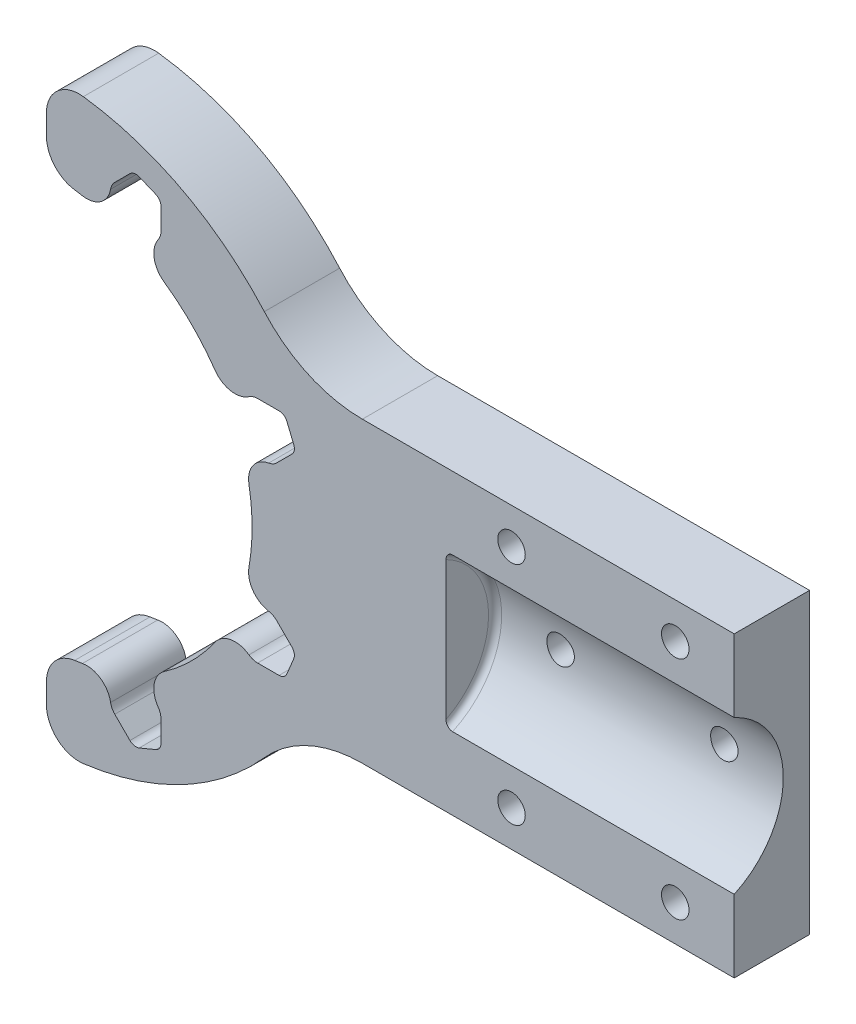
from build123d import *

# Parameters (mm, degrees)
BOSS_EXTRUDE1_DEPTH     = 50
BOSS_EXTRUDE2_DEPTH     = 11.5
BOSS_EXTRUDE3_DEPTH     = 6
CUT_EXTRUDE1_DEPTH      = 72.645324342
FILLET6_R               = 20
FILLET7_R               = 1
SKETCH6_R               = 2.1
CUT_EXTRUDE2_DEPTH      = 72.64532448
BOSS_EXTRUDE4_START     = -11.5
BOSS_EXTRUDE4_DEPTH     = 11.5
FILLET11_R              = 5
CUT_EXTRUDE3_DEPTH      = 72.448380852
CUT_EXTRUDE3_DEPTH_BACK = 72.448380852
SKETCH9_R               = 2.1
SKETCH13_R              = 5
SKETCH13_R_2            = 2.2
BOSS_EXTRUDE7_DEPTH     = 9.65
FILLET13_R              = 3


with BuildPart() as part:
    # Sketch1 → Boss-Extrude1 (new body)
    with BuildSketch(Plane.YZ):
        with BuildLine():
            Line((-11.683321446, 0), (-22.75, 0))
            Line((-22.75, 0), (-22.75, -11.5))
            Line((-22.75, -11.5), (22.75, -11.5))
            Line((22.75, -11.5), (22.75, 0))
            Line((22.75, 0), (11.683321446, 0))
            ThreePointArc((11.683321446, 0), (0, -7.5), (-11.683321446, 0))
        make_face()
    extrude(amount=BOSS_EXTRUDE1_DEPTH)

    # Sketch3 → Boss-Extrude2 (add)
    with BuildSketch(Plane.XY):
        with BuildLine():
            Line((0, 22.75), (-16.813091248, 22.75))
            ThreePointArc((-16.813091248, 22.75), (-33.039068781, 38.646086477), (-55, 44.45))
            Line((-55, 44.45), (-55, -44.45))
            ThreePointArc((-55, -44.45), (-33.039068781, -38.646086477), (-16.813091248, -22.75))
            Line((-16.813091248, -22.75), (0, -22.75))
            Line((0, -22.75), (0, 22.75))
        make_face()
    extrude(amount=-BOSS_EXTRUDE2_DEPTH)

    # Sketch4 → Boss-Extrude3 (add)
    with BuildSketch(Plane.YZ):
        with BuildLine():
            Line((11.683321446, 0), (-11.683321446, 0))
            ThreePointArc((-11.683321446, 0), (0, -7.5), (11.683321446, 0))
        make_face()
    extrude(amount=BOSS_EXTRUDE3_DEPTH)

    # Sketch5 → Cut-Extrude1 (cut, through all)
    with BuildSketch(Plane(origin=(0, 0, -11.5), x_dir=(1, 0, 0), z_dir=(0, 0, -1))):
        with BuildLine():
            Line((-18.104928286, 16.759017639), (-17.06082958, 14.238340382))
            ThreePointArc((-17.06082958, 14.238340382), (-16.975470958, 13.371679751), (-17.385988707, 12.603655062))
            Line((-17.385988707, 12.603655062), (-19.698227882, 10.291415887))
            ThreePointArc((-19.698227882, 10.291415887), (-20.315069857, 9.839864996), (-21.039526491, 9.595826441))
            ThreePointArc((-21.039526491, 9.595826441), (-23.307895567, 8.156938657), (-23.888378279, 5.534166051))
            ThreePointArc((-23.888378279, 5.534166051), (-23.4, 0), (-23.888378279, -5.534166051))
            ThreePointArc((-23.888378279, -5.534166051), (-23.307895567, -8.156938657), (-21.039526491, -9.595826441))
            ThreePointArc((-21.039526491, -9.595826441), (-20.315069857, -9.839864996), (-19.698227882, -10.291415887))
            Line((-19.698227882, -10.291415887), (-17.385988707, -12.603655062))
            ThreePointArc((-17.385988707, -12.603655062), (-16.975470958, -13.371679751), (-17.06082958, -14.238340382))
            Line((-17.06082958, -14.238340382), (-18.104928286, -16.759017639))
            ThreePointArc((-18.104928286, -16.759017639), (-18.657392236, -17.432196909), (-19.490747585, -17.684992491))
            Line((-19.490747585, -17.684992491), (-22.760747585, -17.684992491))
            ThreePointArc((-22.760747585, -17.684992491), (-23.516215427, -17.568114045), (-24.201044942, -17.228407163))
            ThreePointArc((-24.201044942, -17.228407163), (-26.822471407, -16.641875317), (-29.087514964, -18.085992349))
            ThreePointArc((-29.087514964, -18.085992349), (-32.655425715, -22.344574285), (-36.914007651, -25.912485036))
            ThreePointArc((-36.914007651, -25.912485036), (-38.358124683, -28.177528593), (-37.771592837, -30.798955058))
            ThreePointArc((-37.771592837, -30.798955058), (-37.431885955, -31.483784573), (-37.315007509, -32.239252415))
            Line((-37.315007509, -32.239252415), (-37.315007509, -35.509252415))
            ThreePointArc((-37.315007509, -35.509252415), (-37.567803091, -36.342607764), (-38.240982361, -36.895071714))
            Line((-38.240982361, -36.895071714), (-40.761659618, -37.93917042))
            ThreePointArc((-40.761659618, -37.93917042), (-41.628320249, -38.024529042), (-42.396344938, -37.614011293))
            Line((-42.396344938, -37.614011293), (-44.708584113, -35.301772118))
            ThreePointArc((-44.708584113, -35.301772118), (-45.160135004, -34.684930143), (-45.404173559, -33.960473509))
            ThreePointArc((-45.404173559, -33.960473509), (-46.843061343, -31.692104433), (-49.465833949, -31.111621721))
            ThreePointArc((-49.465833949, -31.111621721), (-52.222163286, -31.477668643), (-55, -31.6))
            Line((-55, -31.6), (-55, 31.6))
            ThreePointArc((-55, 31.6), (-52.222163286, 31.477668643), (-49.465833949, 31.111621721))
            ThreePointArc((-49.465833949, 31.111621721), (-46.843061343, 31.692104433), (-45.404173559, 33.960473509))
            ThreePointArc((-45.404173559, 33.960473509), (-45.160135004, 34.684930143), (-44.708584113, 35.301772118))
            Line((-44.708584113, 35.301772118), (-42.396344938, 37.614011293))
            ThreePointArc((-42.396344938, 37.614011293), (-41.628320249, 38.024529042), (-40.761659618, 37.93917042))
            Line((-40.761659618, 37.93917042), (-38.240982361, 36.895071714))
            ThreePointArc((-38.240982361, 36.895071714), (-37.567803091, 36.342607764), (-37.315007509, 35.509252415))
            Line((-37.315007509, 35.509252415), (-37.315007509, 32.239252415))
            ThreePointArc((-37.315007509, 32.239252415), (-37.431885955, 31.483784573), (-37.771592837, 30.798955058))
            ThreePointArc((-37.771592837, 30.798955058), (-38.358124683, 28.177528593), (-36.914007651, 25.912485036))
            ThreePointArc((-36.914007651, 25.912485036), (-32.655425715, 22.344574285), (-29.087514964, 18.085992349))
            ThreePointArc((-29.087514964, 18.085992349), (-26.822471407, 16.641875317), (-24.201044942, 17.228407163))
            ThreePointArc((-24.201044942, 17.228407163), (-23.516215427, 17.568114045), (-22.760747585, 17.684992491))
            Line((-22.760747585, 17.684992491), (-19.490747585, 17.684992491))
            ThreePointArc((-19.490747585, 17.684992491), (-18.657392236, 17.432196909), (-18.104928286, 16.759017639))
        make_face()
    extrude(amount=-CUT_EXTRUDE1_DEPTH, mode=Mode.SUBTRACT)

    # Fillet6
    fillet6_edges = [part.edges().sort_by_distance(p)[0] for p in [
        (-16.813091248, -22.75, -5.75),
        (-16.813091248, 22.75, -5.75),
    ]]
    fillet(fillet6_edges, radius=FILLET6_R)

    # Fillet7
    fillet7_edges = [part.edges().sort_by_distance(p)[0] for p in [
        (6, 0, -7.5),
    ]]
    fillet(fillet7_edges, radius=FILLET7_R)

    # Sketch6 → Cut-Extrude2 (cut, through all)
    with BuildSketch(Plane.XY):
        with Locations((41, 17.25)):
            Circle(SKETCH6_R)
        with Locations((16, 17.25)):
            Circle(SKETCH6_R)
        with Locations((16, -17.25)):
            Circle(SKETCH6_R)
        with Locations((41, -17.25)):
            Circle(SKETCH6_R)
    extrude(amount=-CUT_EXTRUDE2_DEPTH, mode=Mode.SUBTRACT)

    # Sketch8 → Boss-Extrude4 (add)
    with BuildSketch(Plane.XY.offset(BOSS_EXTRUDE4_START)):
        with BuildLine():
            Line((-19.490747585, -17.484992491), (-22.760747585, -17.484992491))
            ThreePointArc((-22.760747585, -17.484992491), (-23.455777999, -17.37746432), (-24.085821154, -17.064933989))
            ThreePointArc((-24.085821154, -17.064933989), (-26.857043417, -16.444886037), (-29.251518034, -17.971524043))
            ThreePointArc((-29.251518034, -17.971524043), (-32.796847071, -22.203152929), (-37.028475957, -25.748481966))
            ThreePointArc((-37.028475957, -25.748481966), (-38.555113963, -28.142956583), (-37.935066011, -30.914178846))
            ThreePointArc((-37.935066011, -30.914178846), (-37.62253568, -31.544222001), (-37.515007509, -32.239252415))
            Line((-37.515007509, -32.239252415), (-37.515007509, -35.509252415))
            ThreePointArc((-37.515007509, -35.509252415), (-37.734097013, -36.231493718), (-38.317519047, -36.710295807))
            Line((-38.317519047, -36.710295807), (-40.838196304, -37.754394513))
            ThreePointArc((-40.838196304, -37.754394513), (-41.589302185, -37.828371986), (-42.254923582, -37.472589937))
            Line((-42.254923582, -37.472589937), (-44.567162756, -35.160350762))
            ThreePointArc((-44.567162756, -35.160350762), (-44.982589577, -34.592856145), (-45.207105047, -33.926356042))
            ThreePointArc((-45.207105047, -33.926356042), (-46.72821499, -31.528365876), (-49.500860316, -30.914712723))
            ThreePointArc((-49.500860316, -30.914712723), (-52.239744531, -31.278442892), (-55, -31.4))
            Line((-55, -31.4), (-55, -31.6))
            ThreePointArc((-55, -31.6), (-52.222163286, -31.477668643), (-49.465833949, -31.111621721))
            ThreePointArc((-49.465833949, -31.111621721), (-46.843061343, -31.692104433), (-45.404173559, -33.960473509))
            ThreePointArc((-45.404173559, -33.960473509), (-45.160135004, -34.684930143), (-44.708584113, -35.301772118))
            Line((-44.708584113, -35.301772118), (-42.396344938, -37.614011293))
            ThreePointArc((-42.396344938, -37.614011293), (-41.628320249, -38.024529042), (-40.761659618, -37.93917042))
            Line((-40.761659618, -37.93917042), (-38.240982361, -36.895071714))
            ThreePointArc((-38.240982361, -36.895071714), (-37.567803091, -36.342607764), (-37.315007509, -35.509252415))
            Line((-37.315007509, -35.509252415), (-37.315007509, -32.239252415))
            ThreePointArc((-37.315007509, -32.239252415), (-37.431885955, -31.483784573), (-37.771592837, -30.798955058))
            ThreePointArc((-37.771592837, -30.798955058), (-38.358124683, -28.177528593), (-36.914007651, -25.912485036))
            ThreePointArc((-36.914007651, -25.912485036), (-32.655425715, -22.344574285), (-29.087514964, -18.085992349))
            ThreePointArc((-29.087514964, -18.085992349), (-26.822471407, -16.641875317), (-24.201044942, -17.228407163))
            ThreePointArc((-24.201044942, -17.228407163), (-23.516215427, -17.568114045), (-22.760747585, -17.684992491))
            Line((-22.760747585, -17.684992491), (-19.490747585, -17.684992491))
            ThreePointArc((-19.490747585, -17.684992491), (-18.657392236, -17.432196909), (-18.104928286, -16.759017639))
            Line((-18.104928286, -16.759017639), (-17.06082958, -14.238340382))
            ThreePointArc((-17.06082958, -14.238340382), (-16.975470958, -13.371679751), (-17.385988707, -12.603655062))
            Line((-17.385988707, -12.603655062), (-19.698227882, -10.291415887))
            ThreePointArc((-19.698227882, -10.291415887), (-20.315069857, -9.839864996), (-21.039526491, -9.595826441))
            ThreePointArc((-21.039526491, -9.595826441), (-23.307895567, -8.156938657), (-23.888378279, -5.534166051))
            ThreePointArc((-23.888378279, -5.534166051), (-23.4, 0), (-23.888378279, 5.534166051))
            ThreePointArc((-23.888378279, 5.534166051), (-23.307895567, 8.156938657), (-21.039526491, 9.595826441))
            ThreePointArc((-21.039526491, 9.595826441), (-20.315069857, 9.839864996), (-19.698227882, 10.291415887))
            Line((-19.698227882, 10.291415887), (-17.385988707, 12.603655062))
            ThreePointArc((-17.385988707, 12.603655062), (-16.975470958, 13.371679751), (-17.06082958, 14.238340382))
            Line((-17.06082958, 14.238340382), (-18.104928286, 16.759017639))
            ThreePointArc((-18.104928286, 16.759017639), (-18.657392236, 17.432196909), (-19.490747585, 17.684992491))
            Line((-19.490747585, 17.684992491), (-22.760747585, 17.684992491))
            ThreePointArc((-22.760747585, 17.684992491), (-23.516215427, 17.568114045), (-24.201044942, 17.228407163))
            ThreePointArc((-24.201044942, 17.228407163), (-26.822471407, 16.641875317), (-29.087514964, 18.085992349))
            ThreePointArc((-29.087514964, 18.085992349), (-32.655425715, 22.344574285), (-36.914007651, 25.912485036))
            ThreePointArc((-36.914007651, 25.912485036), (-38.358124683, 28.177528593), (-37.771592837, 30.798955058))
            ThreePointArc((-37.771592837, 30.798955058), (-37.431885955, 31.483784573), (-37.315007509, 32.239252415))
            Line((-37.315007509, 32.239252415), (-37.315007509, 35.509252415))
            ThreePointArc((-37.315007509, 35.509252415), (-37.567803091, 36.342607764), (-38.240982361, 36.895071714))
            Line((-38.240982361, 36.895071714), (-40.761659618, 37.93917042))
            ThreePointArc((-40.761659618, 37.93917042), (-41.628320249, 38.024529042), (-42.396344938, 37.614011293))
            Line((-42.396344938, 37.614011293), (-44.708584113, 35.301772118))
            ThreePointArc((-44.708584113, 35.301772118), (-45.160135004, 34.684930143), (-45.404173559, 33.960473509))
            ThreePointArc((-45.404173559, 33.960473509), (-46.843061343, 31.692104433), (-49.465833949, 31.111621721))
            ThreePointArc((-49.465833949, 31.111621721), (-52.222163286, 31.477668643), (-55, 31.6))
            Line((-55, 31.6), (-55, 31.4))
            ThreePointArc((-55, 31.4), (-52.239744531, 31.278442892), (-49.500860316, 30.914712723))
            ThreePointArc((-49.500860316, 30.914712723), (-46.72821499, 31.528365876), (-45.207105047, 33.926356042))
            ThreePointArc((-45.207105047, 33.926356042), (-44.982589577, 34.592856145), (-44.567162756, 35.160350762))
            Line((-44.567162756, 35.160350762), (-42.254923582, 37.472589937))
            ThreePointArc((-42.254923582, 37.472589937), (-41.589302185, 37.828371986), (-40.838196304, 37.754394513))
            Line((-40.838196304, 37.754394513), (-38.317519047, 36.710295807))
            ThreePointArc((-38.317519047, 36.710295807), (-37.734097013, 36.231493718), (-37.515007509, 35.509252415))
            Line((-37.515007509, 35.509252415), (-37.515007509, 32.239252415))
            ThreePointArc((-37.515007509, 32.239252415), (-37.62253568, 31.544222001), (-37.935066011, 30.914178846))
            ThreePointArc((-37.935066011, 30.914178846), (-38.555113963, 28.142956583), (-37.028475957, 25.748481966))
            ThreePointArc((-37.028475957, 25.748481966), (-32.796847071, 22.203152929), (-29.251518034, 17.971524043))
            ThreePointArc((-29.251518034, 17.971524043), (-26.857043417, 16.444886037), (-24.085821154, 17.064933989))
            ThreePointArc((-24.085821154, 17.064933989), (-23.455777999, 17.37746432), (-22.760747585, 17.484992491))
            Line((-22.760747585, 17.484992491), (-19.490747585, 17.484992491))
            ThreePointArc((-19.490747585, 17.484992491), (-18.768506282, 17.265902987), (-18.289704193, 16.682480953))
            Line((-18.289704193, 16.682480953), (-17.245605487, 14.161803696))
            ThreePointArc((-17.245605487, 14.161803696), (-17.171628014, 13.410697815), (-17.527410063, 12.745076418))
            Line((-17.527410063, 12.745076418), (-19.839649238, 10.432837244))
            ThreePointArc((-19.839649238, 10.432837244), (-20.407143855, 10.017410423), (-21.073643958, 9.792894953))
            ThreePointArc((-21.073643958, 9.792894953), (-23.471634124, 8.27178501), (-24.085287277, 5.499139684))
            ThreePointArc((-24.085287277, 5.499139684), (-23.6, 0), (-24.085287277, -5.499139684))
            ThreePointArc((-24.085287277, -5.499139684), (-23.471634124, -8.27178501), (-21.073643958, -9.792894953))
            ThreePointArc((-21.073643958, -9.792894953), (-20.407143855, -10.017410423), (-19.839649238, -10.432837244))
            Line((-19.839649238, -10.432837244), (-17.527410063, -12.745076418))
            ThreePointArc((-17.527410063, -12.745076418), (-17.171628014, -13.410697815), (-17.245605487, -14.161803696))
            Line((-17.245605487, -14.161803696), (-18.289704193, -16.682480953))
            ThreePointArc((-18.289704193, -16.682480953), (-18.768506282, -17.265902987), (-19.490747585, -17.484992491))
        make_face()
    extrude(amount=BOSS_EXTRUDE4_DEPTH)

    # Fillet11
    fillet11_edges = [part.edges().sort_by_distance(p)[0] for p in [
        (-55, -44.45, -5.75),
        (-55, 44.45, -5.75),
        (-55, -31.4, -5.75),
        (-55, 31.4, -5.75),
    ]]
    fillet(fillet11_edges, radius=FILLET11_R)

    # Sketch9 → Cut-Extrude3 (cut, two sides: drawn at the far end of the back side and taken through both)
    with BuildSketch(Plane(origin=(0, 0, -11.5), x_dir=(1, 0, 0), z_dir=(0, 0, -1)).offset(-CUT_EXTRUDE3_DEPTH_BACK)):
        with Locations(Location((16, 0, 0), (0, 0, 180))):
            Circle(SKETCH9_R)
        with Locations(Location((41, 0, 0), (0, 0, 180))):
            Circle(SKETCH9_R)
    extrude(amount=CUT_EXTRUDE3_DEPTH + CUT_EXTRUDE3_DEPTH_BACK, mode=Mode.SUBTRACT)

    # Sketch13 → Boss-Extrude7 (add)
    with BuildSketch(Plane(origin=(0, 0, -11.5), x_dir=(1, 0, 0), z_dir=(0, 0, -1))):
        with Locations((28.5, 0)):
            Circle(SKETCH13_R)
        with Locations(Location((28.5, 0, 0), (0, 0, 180))):
            Circle(SKETCH13_R_2, mode=Mode.SUBTRACT)
    extrude(amount=BOSS_EXTRUDE7_DEPTH)

    # Fillet13
    fillet13_edges = [part.edges().sort_by_distance(p)[0] for p in [
        (23.5, 0, -11.5),
    ]]
    fillet(fillet13_edges, radius=FILLET13_R)


solid = part.part
